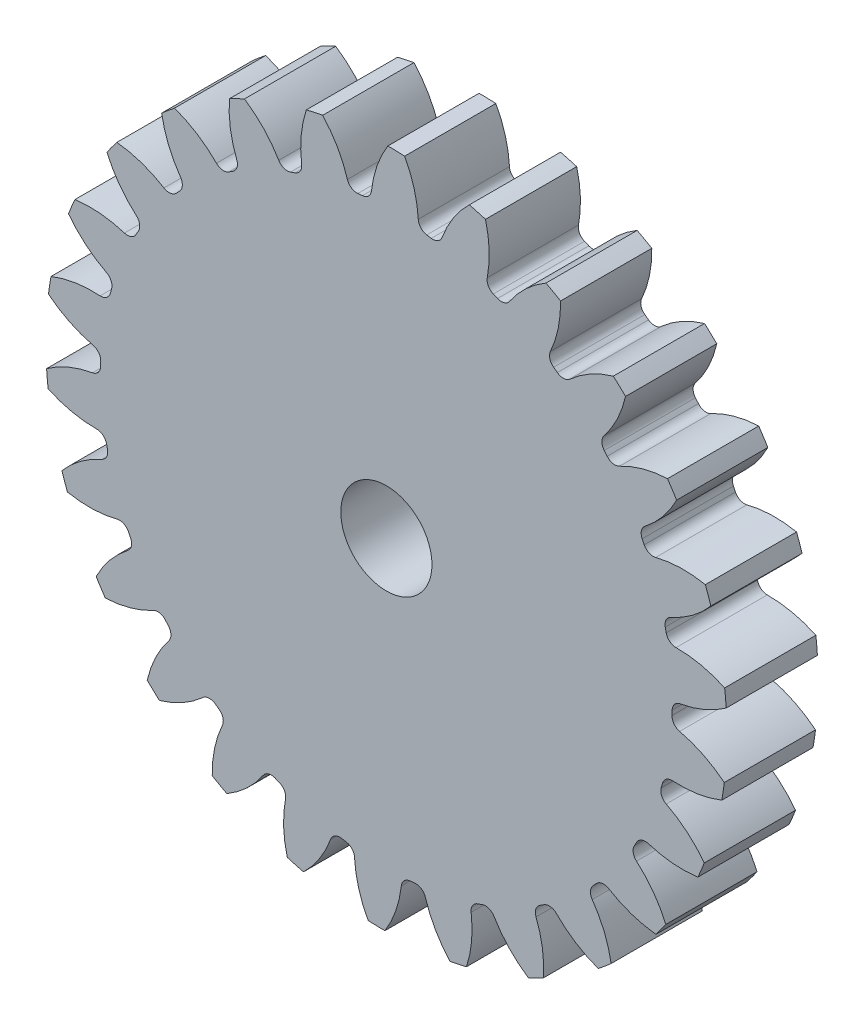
from build123d import *

# Parameters (mm, degrees)
SKETCH3_R         = 474.133333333
GEARBODY_DEPTH    = 127
TOOTHCUT_DEPTH    = 683.446947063
CIRPATTERN1_COUNT = 26
BOREDIA_R         = 63.5
BORE_DEPTH        = 12700


with BuildPart() as part:
    # Sketch3 → gearBody (new body)
    with BuildSketch(Plane.XY):
        Circle(SKETCH3_R)
    extrude(amount=GEARBODY_DEPTH)

    # Sketch2 → toothCut (cut, through all)
    with BuildSketch(Plane.XY):
        with BuildLine():
            ThreePointArc((397.660570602, -14.73120384), (397.766885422, -11.508372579), (397.847081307, -8.284785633))
            ThreePointArc((397.847081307, -8.284785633), (401.162286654, 0.398403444), (409.236135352, 5.002893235))
            ThreePointArc((409.236135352, 5.002893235), (443.272452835, 15.110857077), (474.133333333, 32.667847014))
            ThreePointArc((474.133333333, 32.667847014), (475.058619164, -13.7446122), (471.451474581, -60.025937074))
            ThreePointArc((471.451474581, -60.025937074), (441.657301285, -40.714047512), (408.26232608, -28.655130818))
            ThreePointArc((408.26232608, -28.655130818), (400.468198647, -23.591541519), (397.660570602, -14.73120384))
        make_face()
    toothcut = extrude(amount=TOOTHCUT_DEPTH, mode=Mode.SUBTRACT)

    # CirPattern1: toothCut ×26 about axis
    cirpattern1_axis = Axis((0, 0, 0), (0, 0, 1))
    for i in range(1, CIRPATTERN1_COUNT):
        add(toothcut.rotate(cirpattern1_axis, i * 360 / CIRPATTERN1_COUNT), mode=Mode.SUBTRACT)

    # boreDia → bore (cut, symmetric)
    with BuildSketch(Plane.XY):
        Circle(BOREDIA_R)
    extrude(amount=BORE_DEPTH, both=True, mode=Mode.SUBTRACT)


solid = part.part
